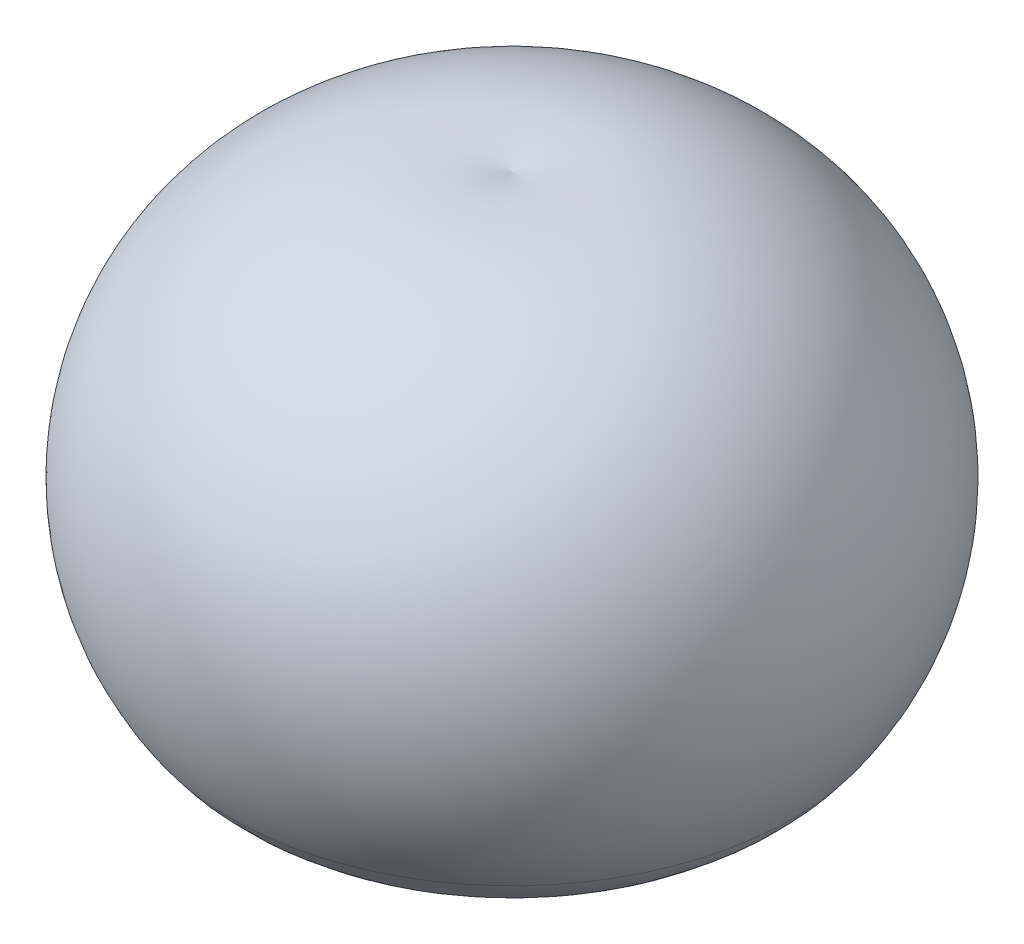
ISO-10303-21;
HEADER;
FILE_DESCRIPTION(('STEP AP214'),'2;1');
FILE_NAME('part.step','',(''),(''),'','','');
FILE_SCHEMA(('AUTOMOTIVE_DESIGN { 1 0 10303 214 1 1 1 1 }'));
ENDSEC;
DATA;
#1=APPLICATION_CONTEXT('core data for automotive mechanical design processes');
#2=APPLICATION_PROTOCOL_DEFINITION('international standard','automotive_design',2000,#1);
#3=PRODUCT_CONTEXT('',#1,'mechanical');
#4=PRODUCT('Part','Part','',(#3));
#5=PRODUCT_RELATED_PRODUCT_CATEGORY('part','',(#4));
#6=PRODUCT_DEFINITION_FORMATION('','',#4);
#7=PRODUCT_DEFINITION_CONTEXT('part definition',#1,'design');
#8=PRODUCT_DEFINITION('design','',#6,#7);
#9=PRODUCT_DEFINITION_SHAPE('','',#8);
#10=(LENGTH_UNIT() NAMED_UNIT(*) SI_UNIT(.MILLI.,.METRE.));
#11=(NAMED_UNIT(*) PLANE_ANGLE_UNIT() SI_UNIT($,.RADIAN.));
#12=(NAMED_UNIT(*) SI_UNIT($,.STERADIAN.) SOLID_ANGLE_UNIT());
#13=UNCERTAINTY_MEASURE_WITH_UNIT(LENGTH_MEASURE(1.E-05),#10,'distance_accuracy_value','');
#14=(GEOMETRIC_REPRESENTATION_CONTEXT(3) GLOBAL_UNCERTAINTY_ASSIGNED_CONTEXT((#13)) GLOBAL_UNIT_ASSIGNED_CONTEXT((#10,
#11,#12)) REPRESENTATION_CONTEXT('',''));
#15=CARTESIAN_POINT('',(0.,0.,0.));
#16=DIRECTION('',(0.,0.,1.));
#17=DIRECTION('',(1.,0.,0.));
#18=AXIS2_PLACEMENT_3D('',#15,#16,#17);
#19=CARTESIAN_POINT('',(0.,980.,344.781847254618));
#20=DIRECTION('',(-1.,0.,0.));
#21=DIRECTION('',(0.,0.,-1.));
#22=AXIS2_PLACEMENT_3D('',#19,#20,#21);
#23=CIRCLE('',#22,997.84780903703);
#24=TRIMMED_CURVE('',#23,(PARAMETER_VALUE(-1.21799762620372)),
(PARAMETER_VALUE(1.21799762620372)),.T.,.PARAMETER.);
#25=CARTESIAN_POINT('',(0.,980.,0.));
#26=DIRECTION('',(0.,-1.,0.));
#27=AXIS1_PLACEMENT('',#25,#26);
#28=SURFACE_OF_REVOLUTION('',#24,#27);
#29=CARTESIAN_POINT('',(0.,1916.3897307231,0.));
#30=VERTEX_POINT('',#29);
#31=VERTEX_LOOP('',#30);
#32=FACE_BOUND('',#31,.T.);
#33=CARTESIAN_POINT('',(0.,930.366445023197,0.));
#34=DIRECTION('',(0.,-1.,0.));
#35=DIRECTION('',(0.,0.,-1.));
#36=AXIS2_PLACEMENT_3D('',#33,#34,#35);
#37=CIRCLE('',#36,651.830795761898);
#38=CARTESIAN_POINT('',(0.,930.366445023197,-651.830795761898));
#39=VERTEX_POINT('',#38);
#40=EDGE_CURVE('E34',#39,#39,#37,.T.);
#41=ORIENTED_EDGE('',*,*,#40,.T.);
#42=EDGE_LOOP('',(#41));
#43=FACE_BOUND('',#42,.T.);
#44=ADVANCED_FACE('F16',(#32,#43),#28,.F.);
#45=CARTESIAN_POINT('',(0.,550.,-400.));
#46=DIRECTION('',(-1.,0.,0.));
#47=DIRECTION('',(0.,0.,-1.));
#48=AXIS2_PLACEMENT_3D('',#45,#46,#47);
#49=CIRCLE('',#48,1857.84780903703);
#50=TRIMMED_CURVE('',#49,(PARAMETER_VALUE(-1.78779830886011)),
(PARAMETER_VALUE(1.78779830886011)),.T.,.PARAMETER.);
#51=CARTESIAN_POINT('',(0.,550.,0.));
#52=DIRECTION('',(0.,-1.,0.));
#53=AXIS1_PLACEMENT('',#51,#52);
#54=SURFACE_OF_REVOLUTION('',#50,#53);
#55=CARTESIAN_POINT('',(0.,-515.617725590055,0.));
#56=DIRECTION('',(0.,-1.,0.));
#57=DIRECTION('',(0.,0.,-1.));
#58=AXIS2_PLACEMENT_3D('',#55,#56,#57);
#59=CIRCLE('',#58,1921.85983075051);
#60=CARTESIAN_POINT('',(0.,-515.617725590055,-1921.85983075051));
#61=VERTEX_POINT('',#60);
#62=EDGE_CURVE('E11',#61,#61,#59,.T.);
#63=ORIENTED_EDGE('',*,*,#62,.F.);
#64=EDGE_LOOP('',(#63));
#65=FACE_BOUND('',#64,.T.);
#66=CARTESIAN_POINT('',(0.,2364.27629691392,0.));
#67=VERTEX_POINT('',#66);
#68=VERTEX_LOOP('',#67);
#69=FACE_BOUND('',#68,.T.);
#70=ADVANCED_FACE('F31',(#65,#69),#54,.T.);
#71=CARTESIAN_POINT('',(0.,56.7242647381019,0.));
#72=DIRECTION('',(0.,-1.,0.));
#73=DIRECTION('',(0.,0.,-1.));
#74=AXIS2_PLACEMENT_3D('',#71,#72,#73);
#75=TOROIDAL_SURFACE('',#74,1104.47075808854,997.847809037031);
#76=CARTESIAN_POINT('',(0.,-237.497048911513,0.));
#77=DIRECTION('',(0.,-1.,0.));
#78=DIRECTION('',(0.,0.,-1.));
#79=AXIS2_PLACEMENT_3D('',#76,#77,#78);
#80=CIRCLE('',#79,150.985536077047);
#81=CARTESIAN_POINT('',(0.,-237.497048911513,-150.985536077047));
#82=VERTEX_POINT('',#81);
#83=EDGE_CURVE('E23',#82,#82,#80,.T.);
#84=ORIENTED_EDGE('',*,*,#83,.F.);
#85=EDGE_LOOP('',(#84));
#86=FACE_BOUND('',#85,.T.);
#87=ORIENTED_EDGE('',*,*,#62,.T.);
#88=EDGE_LOOP('',(#87));
#89=FACE_BOUND('',#88,.T.);
#90=ADVANCED_FACE('F45',(#86,#89),#75,.T.);
#91=CARTESIAN_POINT('',(0.,278.192135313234,0.));
#92=DIRECTION('',(0.,-1.,0.));
#93=DIRECTION('',(0.,0.,-1.));
#94=AXIS2_PLACEMENT_3D('',#91,#92,#93);
#95=DEGENERATE_TOROIDAL_SURFACE('',#94,67.5365805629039,522.397418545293,.T.);
#96=CARTESIAN_POINT('',(0.,125.543058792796,0.));
#97=DIRECTION('',(0.,-1.,0.));
#98=DIRECTION('',(0.,0.,-1.));
#99=AXIS2_PLACEMENT_3D('',#96,#97,#98);
#100=CIRCLE('',#99,567.13374062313);
#101=CARTESIAN_POINT('',(0.,125.543058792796,-567.13374062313));
#102=VERTEX_POINT('',#101);
#103=EDGE_CURVE('E36',#102,#102,#100,.T.);
#104=ORIENTED_EDGE('',*,*,#103,.F.);
#105=EDGE_LOOP('',(#104));
#106=FACE_BOUND('',#105,.T.);
#107=ORIENTED_EDGE('',*,*,#83,.T.);
#108=EDGE_LOOP('',(#107));
#109=FACE_BOUND('',#108,.T.);
#110=ADVANCED_FACE('F43',(#106,#109),#95,.F.);
#111=CARTESIAN_POINT('',(0.,550.,0.));
#112=DIRECTION('',(0.,-1.,0.));
#113=DIRECTION('',(0.,0.,-1.));
#114=AXIS2_PLACEMENT_3D('',#111,#112,#113);
#115=DEGENERATE_TOROIDAL_SURFACE('',#114,400.,456.176919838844,.T.);
#116=ORIENTED_EDGE('',*,*,#40,.F.);
#117=EDGE_LOOP('',(#116));
#118=FACE_BOUND('',#117,.T.);
#119=ORIENTED_EDGE('',*,*,#103,.T.);
#120=EDGE_LOOP('',(#119));
#121=FACE_BOUND('',#120,.T.);
#122=ADVANCED_FACE('F59',(#118,#121),#115,.F.);
#123=CLOSED_SHELL('',(#44,#70,#90,#110,#122));
#124=MANIFOLD_SOLID_BREP('B1',#123);
#125=ADVANCED_BREP_SHAPE_REPRESENTATION('',(#18,#124),#14);
#126=SHAPE_DEFINITION_REPRESENTATION(#9,#125);
ENDSEC;
END-ISO-10303-21;
